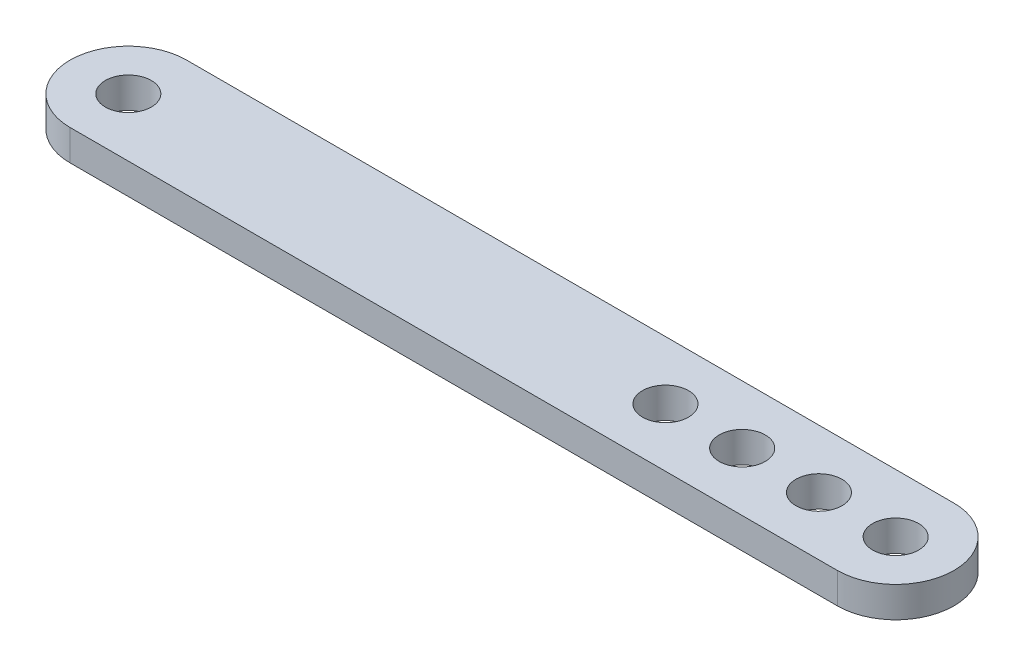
from build123d import *

# Parameters (mm, degrees)
SKETCH1_R           = 1.5
BOSS_EXTRUDE2_DEPTH = 2


with BuildPart() as part:
    # Sketch1 → Boss-Extrude2 (new body)
    with BuildSketch(Plane(origin=(0, 0, 0), x_dir=(1, 0, 0), z_dir=(0, 1, 0))):
        with BuildLine():
            ThreePointArc((25, -3.8), (28.8, 0), (25, 3.8))
            Line((25, 3.8), (-25, 3.8))
            ThreePointArc((-25, 3.8), (-28.8, 0), (-25, -3.8))
            Line((-25, -3.8), (25, -3.8))
        make_face()
        with Locations(Location((20, 0, 0), (0, 0, 270))):
            Circle(SKETCH1_R, mode=Mode.SUBTRACT)
        with Locations(Location((25, 0, 0), (0, 0, 270))):
            Circle(SKETCH1_R, mode=Mode.SUBTRACT)
        with Locations(Location((10, 0, 0), (0, 0, 270))):
            Circle(SKETCH1_R, mode=Mode.SUBTRACT)
        with Locations(Location((15, 0, 0), (0, 0, 270))):
            Circle(SKETCH1_R, mode=Mode.SUBTRACT)
        with Locations(Location((-25, 0, 0), (0, 0, 270))):
            Circle(SKETCH1_R, mode=Mode.SUBTRACT)
    extrude(amount=BOSS_EXTRUDE2_DEPTH)


solid = part.part
